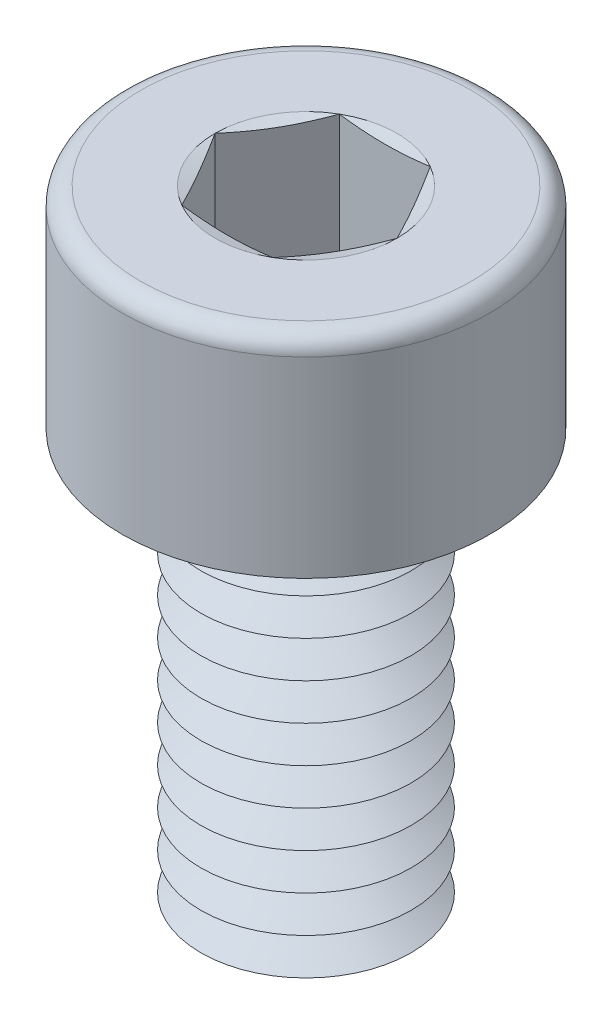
ISO-10303-21;
HEADER;
FILE_DESCRIPTION(('STEP AP214'),'2;1');
FILE_NAME('part.step','',(''),(''),'','','');
FILE_SCHEMA(('AUTOMOTIVE_DESIGN { 1 0 10303 214 1 1 1 1 }'));
ENDSEC;
DATA;
#1=APPLICATION_CONTEXT('core data for automotive mechanical design processes');
#2=APPLICATION_PROTOCOL_DEFINITION('international standard','automotive_design',2000,#1);
#3=PRODUCT_CONTEXT('',#1,'mechanical');
#4=PRODUCT('Part','Part','',(#3));
#5=PRODUCT_RELATED_PRODUCT_CATEGORY('part','',(#4));
#6=PRODUCT_DEFINITION_FORMATION('','',#4);
#7=PRODUCT_DEFINITION_CONTEXT('part definition',#1,'design');
#8=PRODUCT_DEFINITION('design','',#6,#7);
#9=PRODUCT_DEFINITION_SHAPE('','',#8);
#10=(LENGTH_UNIT() NAMED_UNIT(*) SI_UNIT(.MILLI.,.METRE.));
#11=(NAMED_UNIT(*) PLANE_ANGLE_UNIT() SI_UNIT($,.RADIAN.));
#12=(NAMED_UNIT(*) SI_UNIT($,.STERADIAN.) SOLID_ANGLE_UNIT());
#13=UNCERTAINTY_MEASURE_WITH_UNIT(LENGTH_MEASURE(1.E-05),#10,'distance_accuracy_value','');
#14=(GEOMETRIC_REPRESENTATION_CONTEXT(3) GLOBAL_UNCERTAINTY_ASSIGNED_CONTEXT((#13)) GLOBAL_UNIT_ASSIGNED_CONTEXT((#10,
#11,#12)) REPRESENTATION_CONTEXT('',''));
#15=CARTESIAN_POINT('',(0.,0.,0.));
#16=DIRECTION('',(0.,0.,1.));
#17=DIRECTION('',(1.,0.,0.));
#18=AXIS2_PLACEMENT_3D('',#15,#16,#17);
#19=CARTESIAN_POINT('',(0.,2.8,0.));
#20=DIRECTION('',(0.,1.,0.));
#21=DIRECTION('',(0.,0.,1.));
#22=AXIS2_PLACEMENT_3D('',#19,#20,#21);
#23=CONICAL_SURFACE('',#22,1.39378221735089,1.0471975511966);
#24=CARTESIAN_POINT('',(0.,3.15,0.));
#25=DIRECTION('',(0.,1.,0.));
#26=DIRECTION('',(0.,0.,1.));
#27=AXIS2_PLACEMENT_3D('',#24,#25,#26);
#28=CIRCLE('',#27,2.);
#29=CARTESIAN_POINT('',(0.,3.15,2.));
#30=VERTEX_POINT('',#29);
#31=EDGE_CURVE('E399',#30,#30,#28,.T.);
#32=ORIENTED_EDGE('',*,*,#31,.F.);
#33=EDGE_LOOP('',(#32));
#34=FACE_BOUND('',#33,.T.);
#35=CARTESIAN_POINT('',(0.,2.8,0.));
#36=DIRECTION('',(0.,1.,0.));
#37=DIRECTION('',(0.,0.,1.));
#38=AXIS2_PLACEMENT_3D('',#35,#36,#37);
#39=CIRCLE('',#38,1.39378221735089);
#40=CARTESIAN_POINT('',(0.,2.8,1.39378221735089));
#41=VERTEX_POINT('',#40);
#42=EDGE_CURVE('E403',#41,#41,#39,.T.);
#43=ORIENTED_EDGE('',*,*,#42,.T.);
#44=EDGE_LOOP('',(#43));
#45=FACE_BOUND('',#44,.T.);
#46=ADVANCED_FACE('F41',(#34,#45),#23,.T.);
#47=CARTESIAN_POINT('',(0.,2.45,0.));
#48=DIRECTION('',(0.,-1.,0.));
#49=DIRECTION('',(0.,0.,-1.));
#50=AXIS2_PLACEMENT_3D('',#47,#48,#49);
#51=CONICAL_SURFACE('',#50,2.,1.0471975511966);
#52=ORIENTED_EDGE('',*,*,#42,.F.);
#53=EDGE_LOOP('',(#52));
#54=FACE_BOUND('',#53,.T.);
#55=CARTESIAN_POINT('',(0.,2.45,0.));
#56=DIRECTION('',(0.,1.,0.));
#57=DIRECTION('',(0.,0.,1.));
#58=AXIS2_PLACEMENT_3D('',#55,#56,#57);
#59=CIRCLE('',#58,2.);
#60=CARTESIAN_POINT('',(0.,2.45,2.));
#61=VERTEX_POINT('',#60);
#62=EDGE_CURVE('E407',#61,#61,#59,.T.);
#63=ORIENTED_EDGE('',*,*,#62,.T.);
#64=EDGE_LOOP('',(#63));
#65=FACE_BOUND('',#64,.T.);
#66=ADVANCED_FACE('F250',(#54,#65),#51,.T.);
#67=CARTESIAN_POINT('',(0.,0.,0.));
#68=DIRECTION('',(0.,1.,0.));
#69=DIRECTION('',(0.,0.,1.));
#70=AXIS2_PLACEMENT_3D('',#67,#68,#69);
#71=PLANE('',#70);
#72=CARTESIAN_POINT('',(0.,0.,0.));
#73=DIRECTION('',(0.,1.,0.));
#74=DIRECTION('',(0.,0.,1.));
#75=AXIS2_PLACEMENT_3D('',#72,#73,#74);
#76=CIRCLE('',#75,1.39378221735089);
#77=CARTESIAN_POINT('',(0.,0.,1.39378221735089));
#78=VERTEX_POINT('',#77);
#79=EDGE_CURVE('E434',#78,#78,#76,.T.);
#80=ORIENTED_EDGE('',*,*,#79,.F.);
#81=EDGE_LOOP('',(#80));
#82=FACE_BOUND('',#81,.T.);
#83=ADVANCED_FACE('F247',(#82),#71,.F.);
#84=CARTESIAN_POINT('',(0.,0.,0.));
#85=DIRECTION('',(0.,1.,0.));
#86=DIRECTION('',(0.,0.,1.));
#87=AXIS2_PLACEMENT_3D('',#84,#85,#86);
#88=CONICAL_SURFACE('',#87,1.39378221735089,1.0471975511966);
#89=CARTESIAN_POINT('',(0.,0.35,0.));
#90=DIRECTION('',(0.,1.,0.));
#91=DIRECTION('',(0.,0.,1.));
#92=AXIS2_PLACEMENT_3D('',#89,#90,#91);
#93=CIRCLE('',#92,2.);
#94=CARTESIAN_POINT('',(0.,0.35,2.));
#95=VERTEX_POINT('',#94);
#96=EDGE_CURVE('E430',#95,#95,#93,.T.);
#97=ORIENTED_EDGE('',*,*,#96,.F.);
#98=EDGE_LOOP('',(#97));
#99=FACE_BOUND('',#98,.T.);
#100=ORIENTED_EDGE('',*,*,#79,.T.);
#101=EDGE_LOOP('',(#100));
#102=FACE_BOUND('',#101,.T.);
#103=ADVANCED_FACE('F249',(#99,#102),#88,.T.);
#104=CARTESIAN_POINT('',(0.,0.35,0.));
#105=DIRECTION('',(0.,-1.,0.));
#106=DIRECTION('',(0.,0.,-1.));
#107=AXIS2_PLACEMENT_3D('',#104,#105,#106);
#108=CONICAL_SURFACE('',#107,2.,1.0471975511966);
#109=CARTESIAN_POINT('',(0.,0.7,0.));
#110=DIRECTION('',(0.,1.,0.));
#111=DIRECTION('',(0.,0.,1.));
#112=AXIS2_PLACEMENT_3D('',#109,#110,#111);
#113=CIRCLE('',#112,1.39378221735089);
#114=CARTESIAN_POINT('',(0.,0.7,1.39378221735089));
#115=VERTEX_POINT('',#114);
#116=EDGE_CURVE('E426',#115,#115,#113,.T.);
#117=ORIENTED_EDGE('',*,*,#116,.F.);
#118=EDGE_LOOP('',(#117));
#119=FACE_BOUND('',#118,.T.);
#120=ORIENTED_EDGE('',*,*,#96,.T.);
#121=EDGE_LOOP('',(#120));
#122=FACE_BOUND('',#121,.T.);
#123=ADVANCED_FACE('F290',(#119,#122),#108,.T.);
#124=CARTESIAN_POINT('',(0.,0.7,0.));
#125=DIRECTION('',(0.,1.,0.));
#126=DIRECTION('',(0.,0.,1.));
#127=AXIS2_PLACEMENT_3D('',#124,#125,#126);
#128=CONICAL_SURFACE('',#127,1.39378221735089,1.0471975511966);
#129=CARTESIAN_POINT('',(0.,1.05,0.));
#130=DIRECTION('',(0.,1.,0.));
#131=DIRECTION('',(0.,0.,1.));
#132=AXIS2_PLACEMENT_3D('',#129,#130,#131);
#133=CIRCLE('',#132,2.);
#134=CARTESIAN_POINT('',(0.,1.05,2.));
#135=VERTEX_POINT('',#134);
#136=EDGE_CURVE('E422',#135,#135,#133,.T.);
#137=ORIENTED_EDGE('',*,*,#136,.F.);
#138=EDGE_LOOP('',(#137));
#139=FACE_BOUND('',#138,.T.);
#140=ORIENTED_EDGE('',*,*,#116,.T.);
#141=EDGE_LOOP('',(#140));
#142=FACE_BOUND('',#141,.T.);
#143=ADVANCED_FACE('F285',(#139,#142),#128,.T.);
#144=CARTESIAN_POINT('',(0.,1.05,0.));
#145=DIRECTION('',(0.,-1.,0.));
#146=DIRECTION('',(0.,0.,-1.));
#147=AXIS2_PLACEMENT_3D('',#144,#145,#146);
#148=CONICAL_SURFACE('',#147,2.,1.0471975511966);
#149=CARTESIAN_POINT('',(0.,1.4,0.));
#150=DIRECTION('',(0.,1.,0.));
#151=DIRECTION('',(0.,0.,1.));
#152=AXIS2_PLACEMENT_3D('',#149,#150,#151);
#153=CIRCLE('',#152,1.39378221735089);
#154=CARTESIAN_POINT('',(0.,1.4,1.39378221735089));
#155=VERTEX_POINT('',#154);
#156=EDGE_CURVE('E418',#155,#155,#153,.T.);
#157=ORIENTED_EDGE('',*,*,#156,.F.);
#158=EDGE_LOOP('',(#157));
#159=FACE_BOUND('',#158,.T.);
#160=ORIENTED_EDGE('',*,*,#136,.T.);
#161=EDGE_LOOP('',(#160));
#162=FACE_BOUND('',#161,.T.);
#163=ADVANCED_FACE('F282',(#159,#162),#148,.T.);
#164=CARTESIAN_POINT('',(0.,1.4,0.));
#165=DIRECTION('',(0.,1.,0.));
#166=DIRECTION('',(0.,0.,1.));
#167=AXIS2_PLACEMENT_3D('',#164,#165,#166);
#168=CONICAL_SURFACE('',#167,1.39378221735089,1.0471975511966);
#169=CARTESIAN_POINT('',(0.,1.75,0.));
#170=DIRECTION('',(0.,1.,0.));
#171=DIRECTION('',(0.,0.,1.));
#172=AXIS2_PLACEMENT_3D('',#169,#170,#171);
#173=CIRCLE('',#172,2.);
#174=CARTESIAN_POINT('',(0.,1.75,2.));
#175=VERTEX_POINT('',#174);
#176=EDGE_CURVE('E414',#175,#175,#173,.T.);
#177=ORIENTED_EDGE('',*,*,#176,.F.);
#178=EDGE_LOOP('',(#177));
#179=FACE_BOUND('',#178,.T.);
#180=ORIENTED_EDGE('',*,*,#156,.T.);
#181=EDGE_LOOP('',(#180));
#182=FACE_BOUND('',#181,.T.);
#183=ADVANCED_FACE('F276',(#179,#182),#168,.T.);
#184=CARTESIAN_POINT('',(0.,1.75,0.));
#185=DIRECTION('',(0.,-1.,0.));
#186=DIRECTION('',(0.,0.,-1.));
#187=AXIS2_PLACEMENT_3D('',#184,#185,#186);
#188=CONICAL_SURFACE('',#187,2.,1.0471975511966);
#189=CARTESIAN_POINT('',(0.,2.1,0.));
#190=DIRECTION('',(0.,1.,0.));
#191=DIRECTION('',(0.,0.,1.));
#192=AXIS2_PLACEMENT_3D('',#189,#190,#191);
#193=CIRCLE('',#192,1.39378221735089);
#194=CARTESIAN_POINT('',(0.,2.1,1.39378221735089));
#195=VERTEX_POINT('',#194);
#196=EDGE_CURVE('E410',#195,#195,#193,.T.);
#197=ORIENTED_EDGE('',*,*,#196,.F.);
#198=EDGE_LOOP('',(#197));
#199=FACE_BOUND('',#198,.T.);
#200=ORIENTED_EDGE('',*,*,#176,.T.);
#201=EDGE_LOOP('',(#200));
#202=FACE_BOUND('',#201,.T.);
#203=ADVANCED_FACE('F272',(#199,#202),#188,.T.);
#204=CARTESIAN_POINT('',(0.,2.1,0.));
#205=DIRECTION('',(0.,1.,0.));
#206=DIRECTION('',(0.,0.,1.));
#207=AXIS2_PLACEMENT_3D('',#204,#205,#206);
#208=CONICAL_SURFACE('',#207,1.39378221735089,1.0471975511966);
#209=ORIENTED_EDGE('',*,*,#62,.F.);
#210=EDGE_LOOP('',(#209));
#211=FACE_BOUND('',#210,.T.);
#212=ORIENTED_EDGE('',*,*,#196,.T.);
#213=EDGE_LOOP('',(#212));
#214=FACE_BOUND('',#213,.T.);
#215=ADVANCED_FACE('F275',(#211,#214),#208,.T.);
#216=CARTESIAN_POINT('',(0.,3.5,0.));
#217=DIRECTION('',(0.,1.,0.));
#218=DIRECTION('',(0.,0.,1.));
#219=AXIS2_PLACEMENT_3D('',#216,#217,#218);
#220=CONICAL_SURFACE('',#219,1.39378221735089,1.0471975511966);
#221=CARTESIAN_POINT('',(0.,3.85,0.));
#222=DIRECTION('',(0.,1.,0.));
#223=DIRECTION('',(0.,0.,1.));
#224=AXIS2_PLACEMENT_3D('',#221,#222,#223);
#225=CIRCLE('',#224,2.);
#226=CARTESIAN_POINT('',(0.,3.85,2.));
#227=VERTEX_POINT('',#226);
#228=EDGE_CURVE('E391',#227,#227,#225,.T.);
#229=ORIENTED_EDGE('',*,*,#228,.F.);
#230=EDGE_LOOP('',(#229));
#231=FACE_BOUND('',#230,.T.);
#232=CARTESIAN_POINT('',(0.,3.5,0.));
#233=DIRECTION('',(0.,1.,0.));
#234=DIRECTION('',(0.,0.,1.));
#235=AXIS2_PLACEMENT_3D('',#232,#233,#234);
#236=CIRCLE('',#235,1.39378221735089);
#237=CARTESIAN_POINT('',(0.,3.5,1.39378221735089));
#238=VERTEX_POINT('',#237);
#239=EDGE_CURVE('E395',#238,#238,#236,.T.);
#240=ORIENTED_EDGE('',*,*,#239,.T.);
#241=EDGE_LOOP('',(#240));
#242=FACE_BOUND('',#241,.T.);
#243=ADVANCED_FACE('F280',(#231,#242),#220,.T.);
#244=CARTESIAN_POINT('',(0.,3.15,0.));
#245=DIRECTION('',(0.,-1.,0.));
#246=DIRECTION('',(0.,0.,-1.));
#247=AXIS2_PLACEMENT_3D('',#244,#245,#246);
#248=CONICAL_SURFACE('',#247,2.,1.0471975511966);
#249=ORIENTED_EDGE('',*,*,#239,.F.);
#250=EDGE_LOOP('',(#249));
#251=FACE_BOUND('',#250,.T.);
#252=ORIENTED_EDGE('',*,*,#31,.T.);
#253=EDGE_LOOP('',(#252));
#254=FACE_BOUND('',#253,.T.);
#255=ADVANCED_FACE('F669',(#251,#254),#248,.T.);
#256=CARTESIAN_POINT('',(0.,4.2,0.));
#257=DIRECTION('',(0.,1.,0.));
#258=DIRECTION('',(0.,0.,1.));
#259=AXIS2_PLACEMENT_3D('',#256,#257,#258);
#260=CONICAL_SURFACE('',#259,1.39378221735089,1.0471975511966);
#261=CARTESIAN_POINT('',(0.,4.55,0.));
#262=DIRECTION('',(0.,1.,0.));
#263=DIRECTION('',(0.,0.,1.));
#264=AXIS2_PLACEMENT_3D('',#261,#262,#263);
#265=CIRCLE('',#264,2.);
#266=CARTESIAN_POINT('',(0.,4.55,2.));
#267=VERTEX_POINT('',#266);
#268=EDGE_CURVE('E384',#267,#267,#265,.T.);
#269=ORIENTED_EDGE('',*,*,#268,.F.);
#270=EDGE_LOOP('',(#269));
#271=FACE_BOUND('',#270,.T.);
#272=CARTESIAN_POINT('',(0.,4.2,0.));
#273=DIRECTION('',(0.,1.,0.));
#274=DIRECTION('',(0.,0.,1.));
#275=AXIS2_PLACEMENT_3D('',#272,#273,#274);
#276=CIRCLE('',#275,1.39378221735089);
#277=CARTESIAN_POINT('',(0.,4.2,1.39378221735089));
#278=VERTEX_POINT('',#277);
#279=EDGE_CURVE('E387',#278,#278,#276,.T.);
#280=ORIENTED_EDGE('',*,*,#279,.T.);
#281=EDGE_LOOP('',(#280));
#282=FACE_BOUND('',#281,.T.);
#283=ADVANCED_FACE('F660',(#271,#282),#260,.T.);
#284=CARTESIAN_POINT('',(0.,3.85,0.));
#285=DIRECTION('',(0.,-1.,0.));
#286=DIRECTION('',(0.,0.,-1.));
#287=AXIS2_PLACEMENT_3D('',#284,#285,#286);
#288=CONICAL_SURFACE('',#287,2.,1.0471975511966);
#289=ORIENTED_EDGE('',*,*,#279,.F.);
#290=EDGE_LOOP('',(#289));
#291=FACE_BOUND('',#290,.T.);
#292=ORIENTED_EDGE('',*,*,#228,.T.);
#293=EDGE_LOOP('',(#292));
#294=FACE_BOUND('',#293,.T.);
#295=ADVANCED_FACE('F651',(#291,#294),#288,.T.);
#296=CARTESIAN_POINT('',(0.,4.9,0.));
#297=DIRECTION('',(0.,1.,0.));
#298=DIRECTION('',(0.,0.,1.));
#299=AXIS2_PLACEMENT_3D('',#296,#297,#298);
#300=CONICAL_SURFACE('',#299,1.39378221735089,1.0471975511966);
#301=CARTESIAN_POINT('',(0.,5.25,0.));
#302=DIRECTION('',(0.,1.,0.));
#303=DIRECTION('',(0.,0.,1.));
#304=AXIS2_PLACEMENT_3D('',#301,#302,#303);
#305=CIRCLE('',#304,2.);
#306=CARTESIAN_POINT('',(0.,5.25,2.));
#307=VERTEX_POINT('',#306);
#308=EDGE_CURVE('E376',#307,#307,#305,.T.);
#309=ORIENTED_EDGE('',*,*,#308,.F.);
#310=EDGE_LOOP('',(#309));
#311=FACE_BOUND('',#310,.T.);
#312=CARTESIAN_POINT('',(0.,4.9,0.));
#313=DIRECTION('',(0.,1.,0.));
#314=DIRECTION('',(0.,0.,1.));
#315=AXIS2_PLACEMENT_3D('',#312,#313,#314);
#316=CIRCLE('',#315,1.39378221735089);
#317=CARTESIAN_POINT('',(0.,4.9,1.39378221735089));
#318=VERTEX_POINT('',#317);
#319=EDGE_CURVE('E380',#318,#318,#316,.T.);
#320=ORIENTED_EDGE('',*,*,#319,.T.);
#321=EDGE_LOOP('',(#320));
#322=FACE_BOUND('',#321,.T.);
#323=ADVANCED_FACE('F642',(#311,#322),#300,.T.);
#324=CARTESIAN_POINT('',(0.,4.55,0.));
#325=DIRECTION('',(0.,-1.,0.));
#326=DIRECTION('',(0.,0.,-1.));
#327=AXIS2_PLACEMENT_3D('',#324,#325,#326);
#328=CONICAL_SURFACE('',#327,2.,1.0471975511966);
#329=ORIENTED_EDGE('',*,*,#319,.F.);
#330=EDGE_LOOP('',(#329));
#331=FACE_BOUND('',#330,.T.);
#332=ORIENTED_EDGE('',*,*,#268,.T.);
#333=EDGE_LOOP('',(#332));
#334=FACE_BOUND('',#333,.T.);
#335=ADVANCED_FACE('F633',(#331,#334),#328,.T.);
#336=CARTESIAN_POINT('',(0.,5.6,0.));
#337=DIRECTION('',(0.,1.,0.));
#338=DIRECTION('',(0.,0.,1.));
#339=AXIS2_PLACEMENT_3D('',#336,#337,#338);
#340=CONICAL_SURFACE('',#339,1.39378221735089,1.0471975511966);
#341=CARTESIAN_POINT('',(0.,5.95,0.));
#342=DIRECTION('',(0.,1.,0.));
#343=DIRECTION('',(0.,0.,1.));
#344=AXIS2_PLACEMENT_3D('',#341,#342,#343);
#345=CIRCLE('',#344,2.);
#346=CARTESIAN_POINT('',(0.,5.95,2.));
#347=VERTEX_POINT('',#346);
#348=EDGE_CURVE('E368',#347,#347,#345,.T.);
#349=ORIENTED_EDGE('',*,*,#348,.F.);
#350=EDGE_LOOP('',(#349));
#351=FACE_BOUND('',#350,.T.);
#352=CARTESIAN_POINT('',(0.,5.6,0.));
#353=DIRECTION('',(0.,1.,0.));
#354=DIRECTION('',(0.,0.,1.));
#355=AXIS2_PLACEMENT_3D('',#352,#353,#354);
#356=CIRCLE('',#355,1.39378221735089);
#357=CARTESIAN_POINT('',(0.,5.6,1.39378221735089));
#358=VERTEX_POINT('',#357);
#359=EDGE_CURVE('E372',#358,#358,#356,.T.);
#360=ORIENTED_EDGE('',*,*,#359,.T.);
#361=EDGE_LOOP('',(#360));
#362=FACE_BOUND('',#361,.T.);
#363=ADVANCED_FACE('F624',(#351,#362),#340,.T.);
#364=CARTESIAN_POINT('',(0.,5.25,0.));
#365=DIRECTION('',(0.,-1.,0.));
#366=DIRECTION('',(0.,0.,-1.));
#367=AXIS2_PLACEMENT_3D('',#364,#365,#366);
#368=CONICAL_SURFACE('',#367,2.,1.0471975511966);
#369=ORIENTED_EDGE('',*,*,#359,.F.);
#370=EDGE_LOOP('',(#369));
#371=FACE_BOUND('',#370,.T.);
#372=ORIENTED_EDGE('',*,*,#308,.T.);
#373=EDGE_LOOP('',(#372));
#374=FACE_BOUND('',#373,.T.);
#375=ADVANCED_FACE('F615',(#371,#374),#368,.T.);
#376=CARTESIAN_POINT('',(0.,6.3,0.));
#377=DIRECTION('',(0.,1.,0.));
#378=DIRECTION('',(0.,0.,1.));
#379=AXIS2_PLACEMENT_3D('',#376,#377,#378);
#380=CONICAL_SURFACE('',#379,1.39378221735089,1.0471975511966);
#381=CARTESIAN_POINT('',(0.,6.65,0.));
#382=DIRECTION('',(0.,1.,0.));
#383=DIRECTION('',(0.,0.,1.));
#384=AXIS2_PLACEMENT_3D('',#381,#382,#383);
#385=CIRCLE('',#384,2.);
#386=CARTESIAN_POINT('',(0.,6.65,2.));
#387=VERTEX_POINT('',#386);
#388=EDGE_CURVE('E352',#387,#387,#385,.T.);
#389=ORIENTED_EDGE('',*,*,#388,.F.);
#390=EDGE_LOOP('',(#389));
#391=FACE_BOUND('',#390,.T.);
#392=CARTESIAN_POINT('',(0.,6.3,0.));
#393=DIRECTION('',(0.,1.,0.));
#394=DIRECTION('',(0.,0.,1.));
#395=AXIS2_PLACEMENT_3D('',#392,#393,#394);
#396=CIRCLE('',#395,1.39378221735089);
#397=CARTESIAN_POINT('',(0.,6.3,1.39378221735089));
#398=VERTEX_POINT('',#397);
#399=EDGE_CURVE('E364',#398,#398,#396,.T.);
#400=ORIENTED_EDGE('',*,*,#399,.T.);
#401=EDGE_LOOP('',(#400));
#402=FACE_BOUND('',#401,.T.);
#403=ADVANCED_FACE('F606',(#391,#402),#380,.T.);
#404=CARTESIAN_POINT('',(0.,5.95,0.));
#405=DIRECTION('',(0.,-1.,0.));
#406=DIRECTION('',(0.,0.,-1.));
#407=AXIS2_PLACEMENT_3D('',#404,#405,#406);
#408=CONICAL_SURFACE('',#407,2.,1.0471975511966);
#409=ORIENTED_EDGE('',*,*,#399,.F.);
#410=EDGE_LOOP('',(#409));
#411=FACE_BOUND('',#410,.T.);
#412=ORIENTED_EDGE('',*,*,#348,.T.);
#413=EDGE_LOOP('',(#412));
#414=FACE_BOUND('',#413,.T.);
#415=ADVANCED_FACE('F598',(#411,#414),#408,.T.);
#416=CARTESIAN_POINT('',(0.,7.,0.));
#417=DIRECTION('',(0.,1.,0.));
#418=DIRECTION('',(0.,0.,1.));
#419=AXIS2_PLACEMENT_3D('',#416,#417,#418);
#420=CONICAL_SURFACE('',#419,1.39378221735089,1.0471975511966);
#421=CARTESIAN_POINT('',(0.,7.35,0.));
#422=DIRECTION('',(0.,1.,0.));
#423=DIRECTION('',(0.,0.,1.));
#424=AXIS2_PLACEMENT_3D('',#421,#422,#423);
#425=CIRCLE('',#424,2.);
#426=CARTESIAN_POINT('',(0.,7.35,2.));
#427=VERTEX_POINT('',#426);
#428=EDGE_CURVE('E359',#427,#427,#425,.T.);
#429=ORIENTED_EDGE('',*,*,#428,.F.);
#430=EDGE_LOOP('',(#429));
#431=FACE_BOUND('',#430,.T.);
#432=CARTESIAN_POINT('',(0.,7.,0.));
#433=DIRECTION('',(0.,1.,0.));
#434=DIRECTION('',(0.,0.,1.));
#435=AXIS2_PLACEMENT_3D('',#432,#433,#434);
#436=CIRCLE('',#435,1.39378221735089);
#437=CARTESIAN_POINT('',(0.,7.,1.39378221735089));
#438=VERTEX_POINT('',#437);
#439=EDGE_CURVE('E347',#438,#438,#436,.T.);
#440=ORIENTED_EDGE('',*,*,#439,.T.);
#441=EDGE_LOOP('',(#440));
#442=FACE_BOUND('',#441,.T.);
#443=ADVANCED_FACE('F590',(#431,#442),#420,.T.);
#444=CARTESIAN_POINT('',(0.,6.65,0.));
#445=DIRECTION('',(0.,-1.,0.));
#446=DIRECTION('',(0.,0.,-1.));
#447=AXIS2_PLACEMENT_3D('',#444,#445,#446);
#448=CONICAL_SURFACE('',#447,2.,1.0471975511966);
#449=ORIENTED_EDGE('',*,*,#439,.F.);
#450=EDGE_LOOP('',(#449));
#451=FACE_BOUND('',#450,.T.);
#452=ORIENTED_EDGE('',*,*,#388,.T.);
#453=EDGE_LOOP('',(#452));
#454=FACE_BOUND('',#453,.T.);
#455=ADVANCED_FACE('F194',(#451,#454),#448,.T.);
#456=CARTESIAN_POINT('',(0.,12.,0.));
#457=DIRECTION('',(0.,1.,0.));
#458=DIRECTION('',(0.,0.,1.));
#459=AXIS2_PLACEMENT_3D('',#456,#457,#458);
#460=PLANE('',#459);
#461=CARTESIAN_POINT('',(0.,12.,0.));
#462=DIRECTION('',(0.,1.,0.));
#463=DIRECTION('',(0.,0.,1.));
#464=AXIS2_PLACEMENT_3D('',#461,#462,#463);
#465=CIRCLE('',#464,1.73205080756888);
#466=CARTESIAN_POINT('',(0.866025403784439,12.,1.5));
#467=VERTEX_POINT('',#466);
#468=CARTESIAN_POINT('',(1.73205080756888,12.,0.));
#469=VERTEX_POINT('',#468);
#470=EDGE_CURVE('E121',#467,#469,#465,.T.);
#471=ORIENTED_EDGE('',*,*,#470,.F.);
#472=CARTESIAN_POINT('',(0.,12.,0.));
#473=DIRECTION('',(0.,1.,0.));
#474=DIRECTION('',(0.,0.,1.));
#475=AXIS2_PLACEMENT_3D('',#472,#473,#474);
#476=CIRCLE('',#475,1.73205080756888);
#477=CARTESIAN_POINT('',(-0.866025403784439,12.,1.5));
#478=VERTEX_POINT('',#477);
#479=EDGE_CURVE('E45',#478,#467,#476,.T.);
#480=ORIENTED_EDGE('',*,*,#479,.F.);
#481=CARTESIAN_POINT('',(-1.73205080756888,12.,0.));
#482=VERTEX_POINT('',#481);
#483=EDGE_CURVE('E138',#482,#478,#476,.T.);
#484=ORIENTED_EDGE('',*,*,#483,.F.);
#485=CARTESIAN_POINT('',(-0.866025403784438,12.,-1.5));
#486=VERTEX_POINT('',#485);
#487=EDGE_CURVE('E914',#486,#482,#476,.T.);
#488=ORIENTED_EDGE('',*,*,#487,.F.);
#489=CARTESIAN_POINT('',(0.866025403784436,12.,-1.5));
#490=VERTEX_POINT('',#489);
#491=EDGE_CURVE('E51',#490,#486,#476,.T.);
#492=ORIENTED_EDGE('',*,*,#491,.F.);
#493=EDGE_CURVE('E11',#469,#490,#476,.T.);
#494=ORIENTED_EDGE('',*,*,#493,.F.);
#495=EDGE_LOOP('',(#471,#480,#484,#488,#492,#494));
#496=FACE_BOUND('',#495,.T.);
#497=CARTESIAN_POINT('',(0.,12.,0.));
#498=DIRECTION('',(0.,1.,0.));
#499=DIRECTION('',(0.,0.,1.));
#500=AXIS2_PLACEMENT_3D('',#497,#498,#499);
#501=CIRCLE('',#500,3.15);
#502=CARTESIAN_POINT('',(0.,12.,3.15));
#503=VERTEX_POINT('',#502);
#504=EDGE_CURVE('E478',#503,#503,#501,.T.);
#505=ORIENTED_EDGE('',*,*,#504,.T.);
#506=EDGE_LOOP('',(#505));
#507=FACE_BOUND('',#506,.T.);
#508=ADVANCED_FACE('F140',(#496,#507),#460,.T.);
#509=CARTESIAN_POINT('',(0.,11.65,0.));
#510=DIRECTION('',(0.,1.,0.));
#511=DIRECTION('',(0.,0.,1.));
#512=AXIS2_PLACEMENT_3D('',#509,#510,#511);
#513=TOROIDAL_SURFACE('',#512,3.15,0.35);
#514=CARTESIAN_POINT('',(0.,11.65,0.));
#515=DIRECTION('',(0.,1.,0.));
#516=DIRECTION('',(0.,0.,1.));
#517=AXIS2_PLACEMENT_3D('',#514,#515,#516);
#518=CIRCLE('',#517,3.5);
#519=CARTESIAN_POINT('',(0.,11.65,3.5));
#520=VERTEX_POINT('',#519);
#521=EDGE_CURVE('E481',#520,#520,#518,.F.);
#522=ORIENTED_EDGE('',*,*,#521,.F.);
#523=EDGE_LOOP('',(#522));
#524=FACE_BOUND('',#523,.T.);
#525=ORIENTED_EDGE('',*,*,#504,.F.);
#526=EDGE_LOOP('',(#525));
#527=FACE_BOUND('',#526,.T.);
#528=ADVANCED_FACE('F43',(#524,#527),#513,.T.);
#529=CARTESIAN_POINT('',(0.,12.,0.));
#530=DIRECTION('',(0.,-1.,0.));
#531=DIRECTION('',(0.,0.,-1.));
#532=AXIS2_PLACEMENT_3D('',#529,#530,#531);
#533=CYLINDRICAL_SURFACE('',#532,3.5);
#534=ORIENTED_EDGE('',*,*,#521,.T.);
#535=EDGE_LOOP('',(#534));
#536=FACE_BOUND('',#535,.T.);
#537=CARTESIAN_POINT('',(0.,8.,0.));
#538=DIRECTION('',(0.,1.,0.));
#539=DIRECTION('',(0.,0.,1.));
#540=AXIS2_PLACEMENT_3D('',#537,#538,#539);
#541=CIRCLE('',#540,3.5);
#542=CARTESIAN_POINT('',(0.,8.,3.5));
#543=VERTEX_POINT('',#542);
#544=EDGE_CURVE('E465',#543,#543,#541,.T.);
#545=ORIENTED_EDGE('',*,*,#544,.T.);
#546=EDGE_LOOP('',(#545));
#547=FACE_BOUND('',#546,.T.);
#548=ADVANCED_FACE('F242',(#536,#547),#533,.T.);
#549=CARTESIAN_POINT('',(0.,8.,0.));
#550=DIRECTION('',(0.,1.,0.));
#551=DIRECTION('',(0.,0.,1.));
#552=AXIS2_PLACEMENT_3D('',#549,#550,#551);
#553=PLANE('',#552);
#554=ORIENTED_EDGE('',*,*,#544,.F.);
#555=EDGE_LOOP('',(#554));
#556=FACE_BOUND('',#555,.T.);
#557=CARTESIAN_POINT('',(0.,8.,0.));
#558=DIRECTION('',(0.,1.,0.));
#559=DIRECTION('',(0.,0.,1.));
#560=AXIS2_PLACEMENT_3D('',#557,#558,#559);
#561=CIRCLE('',#560,2.);
#562=CARTESIAN_POINT('',(0.,8.,2.));
#563=VERTEX_POINT('',#562);
#564=EDGE_CURVE('E474',#563,#563,#561,.T.);
#565=ORIENTED_EDGE('',*,*,#564,.T.);
#566=EDGE_LOOP('',(#565));
#567=FACE_BOUND('',#566,.T.);
#568=ADVANCED_FACE('F238',(#556,#567),#553,.F.);
#569=CARTESIAN_POINT('',(0.,8.,0.));
#570=DIRECTION('',(0.,-1.,0.));
#571=DIRECTION('',(0.,0.,-1.));
#572=AXIS2_PLACEMENT_3D('',#569,#570,#571);
#573=CYLINDRICAL_SURFACE('',#572,2.);
#574=ORIENTED_EDGE('',*,*,#428,.T.);
#575=EDGE_LOOP('',(#574));
#576=FACE_BOUND('',#575,.T.);
#577=ORIENTED_EDGE('',*,*,#564,.F.);
#578=EDGE_LOOP('',(#577));
#579=FACE_BOUND('',#578,.T.);
#580=ADVANCED_FACE('F241',(#576,#579),#573,.T.);
#581=CARTESIAN_POINT('',(0.,12.,0.));
#582=DIRECTION('',(0.,1.,0.));
#583=DIRECTION('',(0.,0.,1.));
#584=AXIS2_PLACEMENT_3D('',#581,#582,#583);
#585=CONICAL_SURFACE('',#584,1.73205080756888,1.30899693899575);
#586=ORIENTED_EDGE('',*,*,#479,.T.);
#587=CARTESIAN_POINT('',(-2.26080568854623,12.2628876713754,1.5));
#588=CARTESIAN_POINT('',(-2.19307335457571,12.247767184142,1.5));
#589=CARTESIAN_POINT('',(-2.12529797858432,12.2328393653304,1.5));
#590=CARTESIAN_POINT('',(-1.98963961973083,12.203466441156,1.5));
#591=CARTESIAN_POINT('',(-1.92175663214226,12.1890213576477,1.5));
#592=CARTESIAN_POINT('',(-1.71778516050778,12.146529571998,1.5));
#593=CARTESIAN_POINT('',(-1.58151166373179,12.1193574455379,1.5));
#594=CARTESIAN_POINT('',(-1.30947840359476,12.0687885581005,1.5));
#595=CARTESIAN_POINT('',(-1.17372447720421,12.0453610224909,1.5));
#596=CARTESIAN_POINT('',(-0.901404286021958,12.0038503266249,1.5));
#597=CARTESIAN_POINT('',(-0.764838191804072,11.9857660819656,1.5));
#598=CARTESIAN_POINT('',(-0.48929318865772,11.9572920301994,1.5));
#599=CARTESIAN_POINT('',(-0.350304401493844,11.9469908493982,1.5));
#600=CARTESIAN_POINT('',(-0.141571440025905,11.9391816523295,1.5));
#601=CARTESIAN_POINT('',(-0.0719628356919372,11.937851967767,1.5));
#602=CARTESIAN_POINT('',(0.0672555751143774,11.9377933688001,1.5));
#603=CARTESIAN_POINT('',(0.136865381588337,11.9390644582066,1.5));
#604=CARTESIAN_POINT('',(0.346114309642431,11.9467225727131,1.5));
#605=CARTESIAN_POINT('',(0.485619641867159,11.9569747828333,1.5));
#606=CARTESIAN_POINT('',(0.763829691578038,11.9856001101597,1.5));
#607=CARTESIAN_POINT('',(0.902533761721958,12.0039790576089,1.5));
#608=CARTESIAN_POINT('',(1.18270277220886,12.0467752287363,1.5));
#609=CARTESIAN_POINT('',(1.32414472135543,12.0713381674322,1.5));
#610=CARTESIAN_POINT('',(1.60634089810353,12.1241771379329,1.5));
#611=CARTESIAN_POINT('',(1.7470950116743,12.1524537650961,1.5));
#612=CARTESIAN_POINT('',(2.02813528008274,12.2114128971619,1.5));
#613=CARTESIAN_POINT('',(2.16842128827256,12.2420960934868,1.5));
#614=CARTESIAN_POINT('',(2.4486355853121,12.3050575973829,1.5));
#615=CARTESIAN_POINT('',(2.58856386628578,12.3373359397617,1.5));
#616=CARTESIAN_POINT('',(2.86645602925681,12.4025869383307,1.5));
#617=CARTESIAN_POINT('',(3.00442304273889,12.435546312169,1.5));
#618=CARTESIAN_POINT('',(3.28017563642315,12.5022271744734,1.5));
#619=CARTESIAN_POINT('',(3.41796121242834,12.5359486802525,1.5));
#620=CARTESIAN_POINT('',(3.69320305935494,12.6038996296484,1.5));
#621=CARTESIAN_POINT('',(3.83065952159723,12.6381282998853,1.5));
#622=CARTESIAN_POINT('',(4.10546119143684,12.7070087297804,1.5));
#623=CARTESIAN_POINT('',(4.24280640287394,12.7416604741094,1.5));
#624=CARTESIAN_POINT('',(4.38011382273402,12.7764596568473,1.5));
#625=B_SPLINE_CURVE_WITH_KNOTS('',3,(#587,#588,#589,#590,#591,#592,#593,#594,#595,#596,#597,
#598,#599,#600,#601,#602,#603,#604,#605,#606,#607,#608,#609,#610,#611,#612,#613,#614,#615,#616,
#617,#618,#619,#620,#621,#622,#623,#624),.UNSPECIFIED.,.F.,.F.,(4,2,2,2,2,2,2,2,2,2,2,2,2,2,2,2,
2,2,4),(0.,0.208198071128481,0.416405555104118,0.833243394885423,1.24645656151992,
1.65958581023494,2.07735129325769,2.28617008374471,2.49498918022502,2.91428402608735,
3.33388016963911,3.76448033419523,4.19514961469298,4.6259430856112,5.05674596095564,
5.48229088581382,5.90784548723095,6.33280701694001,6.75775319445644),.UNSPECIFIED.);
#626=EDGE_CURVE('E127',#478,#467,#625,.T.);
#627=ORIENTED_EDGE('',*,*,#626,.F.);
#628=EDGE_LOOP('',(#586,#627));
#629=FACE_BOUND('',#628,.T.);
#630=ADVANCED_FACE('F132',(#629),#585,.F.);
#631=ORIENTED_EDGE('',*,*,#483,.T.);
#632=CARTESIAN_POINT('',(-1.73216627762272,12.0000309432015,-0.000200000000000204));
#633=CARTESIAN_POINT('',(-1.69619286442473,11.9903863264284,0.0621077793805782));
#634=CARTESIAN_POINT('',(-1.66015421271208,11.9816304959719,0.124528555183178));
#635=CARTESIAN_POINT('',(-1.58794959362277,11.9662471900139,0.249590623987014));
#636=CARTESIAN_POINT('',(-1.55178358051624,11.9596205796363,0.312231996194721));
#637=CARTESIAN_POINT('',(-1.47954358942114,11.948882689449,0.437355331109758));
#638=CARTESIAN_POINT('',(-1.44347010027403,11.9447586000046,0.499836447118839));
#639=CARTESIAN_POINT('',(-1.37127710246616,11.9392286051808,0.624878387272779));
#640=CARTESIAN_POINT('',(-1.33515760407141,11.9378221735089,0.687439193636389));
#641=CARTESIAN_POINT('',(-1.26291860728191,11.9378221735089,0.81256080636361));
#642=CARTESIAN_POINT('',(-1.22679910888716,11.9392286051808,0.87512161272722));
#643=CARTESIAN_POINT('',(-1.15460611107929,11.9447586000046,1.00016355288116));
#644=CARTESIAN_POINT('',(-1.11853262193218,11.948882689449,1.06264466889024));
#645=CARTESIAN_POINT('',(-1.04629263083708,11.9596205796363,1.18776800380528));
#646=CARTESIAN_POINT('',(-1.01012661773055,11.9662471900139,1.25040937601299));
#647=CARTESIAN_POINT('',(-0.937921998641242,11.9816304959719,1.37547144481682));
#648=CARTESIAN_POINT('',(-0.901883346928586,11.9903863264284,1.43789222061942));
#649=CARTESIAN_POINT('',(-0.865909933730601,12.0000309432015,1.5002));
#650=B_SPLINE_CURVE_WITH_KNOTS('',3,(#632,#633,#634,#635,#636,#637,#638,#639,#640,#641,#642,
#643,#644,#645,#646,#647,#648,#649),.UNSPECIFIED.,.F.,.F.,(4,2,2,2,2,2,2,2,4),(0.,
0.217782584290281,0.435653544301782,0.652399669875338,0.869103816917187,1.08580796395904,
1.30255408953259,1.52042504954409,1.73820763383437),.UNSPECIFIED.);
#651=EDGE_CURVE('E163',#482,#478,#650,.T.);
#652=ORIENTED_EDGE('',*,*,#651,.F.);
#653=EDGE_LOOP('',(#631,#652));
#654=FACE_BOUND('',#653,.T.);
#655=ADVANCED_FACE('F257',(#654),#585,.F.);
#656=ORIENTED_EDGE('',*,*,#487,.T.);
#657=CARTESIAN_POINT('',(-0.865909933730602,12.0000309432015,-1.5002));
#658=CARTESIAN_POINT('',(-0.901883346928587,11.9903863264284,-1.43789222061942));
#659=CARTESIAN_POINT('',(-0.937921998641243,11.9816304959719,-1.37547144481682));
#660=CARTESIAN_POINT('',(-1.01012661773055,11.9662471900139,-1.25040937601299));
#661=CARTESIAN_POINT('',(-1.04629263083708,11.9596205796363,-1.18776800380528));
#662=CARTESIAN_POINT('',(-1.11853262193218,11.948882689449,-1.06264466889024));
#663=CARTESIAN_POINT('',(-1.15460611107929,11.9447586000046,-1.00016355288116));
#664=CARTESIAN_POINT('',(-1.22679910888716,11.9392286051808,-0.87512161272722));
#665=CARTESIAN_POINT('',(-1.26291860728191,11.9378221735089,-0.81256080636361));
#666=CARTESIAN_POINT('',(-1.33515760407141,11.9378221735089,-0.687439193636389));
#667=CARTESIAN_POINT('',(-1.37127710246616,11.9392286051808,-0.624878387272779));
#668=CARTESIAN_POINT('',(-1.44347010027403,11.9447586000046,-0.499836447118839));
#669=CARTESIAN_POINT('',(-1.47954358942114,11.948882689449,-0.437355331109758));
#670=CARTESIAN_POINT('',(-1.55178358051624,11.9596205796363,-0.312231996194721));
#671=CARTESIAN_POINT('',(-1.58794959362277,11.9662471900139,-0.249590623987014));
#672=CARTESIAN_POINT('',(-1.66015421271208,11.9816304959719,-0.124528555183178));
#673=CARTESIAN_POINT('',(-1.69619286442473,11.9903863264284,-0.0621077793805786));
#674=CARTESIAN_POINT('',(-1.73216627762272,12.0000309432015,0.000199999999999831));
#675=B_SPLINE_CURVE_WITH_KNOTS('',3,(#657,#658,#659,#660,#661,#662,#663,#664,#665,#666,#667,
#668,#669,#670,#671,#672,#673,#674),.UNSPECIFIED.,.F.,.F.,(4,2,2,2,2,2,2,2,4),(0.,
0.217782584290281,0.435653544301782,0.652399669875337,0.869103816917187,1.08580796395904,
1.30255408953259,1.52042504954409,1.73820763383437),.UNSPECIFIED.);
#676=EDGE_CURVE('E63',#486,#482,#675,.T.);
#677=ORIENTED_EDGE('',*,*,#676,.F.);
#678=EDGE_LOOP('',(#656,#677));
#679=FACE_BOUND('',#678,.T.);
#680=ADVANCED_FACE('F192',(#679),#585,.F.);
#681=ORIENTED_EDGE('',*,*,#491,.T.);
#682=CARTESIAN_POINT('',(-2.26080568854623,12.2628876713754,-1.5));
#683=CARTESIAN_POINT('',(-2.19307335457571,12.247767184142,-1.5));
#684=CARTESIAN_POINT('',(-2.12529797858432,12.2328393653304,-1.5));
#685=CARTESIAN_POINT('',(-1.98963961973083,12.203466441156,-1.5));
#686=CARTESIAN_POINT('',(-1.92175663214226,12.1890213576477,-1.5));
#687=CARTESIAN_POINT('',(-1.71778516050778,12.146529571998,-1.5));
#688=CARTESIAN_POINT('',(-1.58151166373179,12.1193574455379,-1.5));
#689=CARTESIAN_POINT('',(-1.30947840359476,12.0687885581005,-1.5));
#690=CARTESIAN_POINT('',(-1.17372447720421,12.0453610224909,-1.5));
#691=CARTESIAN_POINT('',(-0.901404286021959,12.0038503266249,-1.5));
#692=CARTESIAN_POINT('',(-0.764838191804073,11.9857660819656,-1.5));
#693=CARTESIAN_POINT('',(-0.489293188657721,11.9572920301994,-1.5));
#694=CARTESIAN_POINT('',(-0.350304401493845,11.9469908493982,-1.5));
#695=CARTESIAN_POINT('',(-0.141571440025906,11.9391816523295,-1.5));
#696=CARTESIAN_POINT('',(-0.071962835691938,11.937851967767,-1.5));
#697=CARTESIAN_POINT('',(0.0672555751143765,11.9377933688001,-1.5));
#698=CARTESIAN_POINT('',(0.136865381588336,11.9390644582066,-1.5));
#699=CARTESIAN_POINT('',(0.34611430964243,11.9467225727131,-1.5));
#700=CARTESIAN_POINT('',(0.485619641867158,11.9569747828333,-1.5));
#701=CARTESIAN_POINT('',(0.763829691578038,11.9856001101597,-1.5));
#702=CARTESIAN_POINT('',(0.902533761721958,12.0039790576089,-1.5));
#703=CARTESIAN_POINT('',(1.18270277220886,12.0467752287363,-1.5));
#704=CARTESIAN_POINT('',(1.32414472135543,12.0713381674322,-1.5));
#705=CARTESIAN_POINT('',(1.60634089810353,12.1241771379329,-1.5));
#706=CARTESIAN_POINT('',(1.7470950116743,12.1524537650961,-1.5));
#707=CARTESIAN_POINT('',(2.02813528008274,12.2114128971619,-1.5));
#708=CARTESIAN_POINT('',(2.16842128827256,12.2420960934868,-1.5));
#709=CARTESIAN_POINT('',(2.4486355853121,12.3050575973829,-1.5));
#710=CARTESIAN_POINT('',(2.58856386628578,12.3373359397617,-1.5));
#711=CARTESIAN_POINT('',(2.86645602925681,12.4025869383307,-1.5));
#712=CARTESIAN_POINT('',(3.00442304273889,12.435546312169,-1.5));
#713=CARTESIAN_POINT('',(3.28017563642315,12.5022271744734,-1.5));
#714=CARTESIAN_POINT('',(3.41796121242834,12.5359486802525,-1.5));
#715=CARTESIAN_POINT('',(3.69320305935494,12.6038996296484,-1.5));
#716=CARTESIAN_POINT('',(3.83065952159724,12.6381282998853,-1.5));
#717=CARTESIAN_POINT('',(4.10546119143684,12.7070087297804,-1.5));
#718=CARTESIAN_POINT('',(4.24280640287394,12.7416604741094,-1.5));
#719=CARTESIAN_POINT('',(4.38011382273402,12.7764596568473,-1.5));
#720=B_SPLINE_CURVE_WITH_KNOTS('',3,(#682,#683,#684,#685,#686,#687,#688,#689,#690,#691,#692,
#693,#694,#695,#696,#697,#698,#699,#700,#701,#702,#703,#704,#705,#706,#707,#708,#709,#710,#711,
#712,#713,#714,#715,#716,#717,#718,#719),.UNSPECIFIED.,.F.,.F.,(4,2,2,2,2,2,2,2,2,2,2,2,2,2,2,2,
2,2,4),(0.,0.208198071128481,0.416405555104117,0.833243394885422,1.24645656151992,
1.65958581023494,2.07735129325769,2.28617008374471,2.49498918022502,2.91428402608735,
3.33388016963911,3.76448033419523,4.19514961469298,4.62594308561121,5.05674596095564,
5.48229088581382,5.90784548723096,6.33280701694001,6.75775319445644),.UNSPECIFIED.);
#721=EDGE_CURVE('E213',#490,#486,#720,.F.);
#722=ORIENTED_EDGE('',*,*,#721,.F.);
#723=EDGE_LOOP('',(#681,#722));
#724=FACE_BOUND('',#723,.T.);
#725=ADVANCED_FACE('F187',(#724),#585,.F.);
#726=ORIENTED_EDGE('',*,*,#493,.T.);
#727=CARTESIAN_POINT('',(1.73216627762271,12.0000309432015,0.000200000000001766));
#728=CARTESIAN_POINT('',(1.69619286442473,11.9903863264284,-0.0621077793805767));
#729=CARTESIAN_POINT('',(1.66015421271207,11.9816304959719,-0.124528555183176));
#730=CARTESIAN_POINT('',(1.58794959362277,11.9662471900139,-0.249590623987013));
#731=CARTESIAN_POINT('',(1.55178358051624,11.9596205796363,-0.31223199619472));
#732=CARTESIAN_POINT('',(1.47954358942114,11.948882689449,-0.437355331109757));
#733=CARTESIAN_POINT('',(1.44347010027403,11.9447586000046,-0.499836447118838));
#734=CARTESIAN_POINT('',(1.37127710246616,11.9392286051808,-0.624878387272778));
#735=CARTESIAN_POINT('',(1.33515760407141,11.9378221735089,-0.687439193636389));
#736=CARTESIAN_POINT('',(1.26291860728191,11.9378221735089,-0.81256080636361));
#737=CARTESIAN_POINT('',(1.22679910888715,11.9392286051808,-0.87512161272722));
#738=CARTESIAN_POINT('',(1.15460611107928,11.9447586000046,-1.00016355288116));
#739=CARTESIAN_POINT('',(1.11853262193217,11.948882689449,-1.06264466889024));
#740=CARTESIAN_POINT('',(1.04629263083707,11.9596205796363,-1.18776800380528));
#741=CARTESIAN_POINT('',(1.01012661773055,11.9662471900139,-1.25040937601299));
#742=CARTESIAN_POINT('',(0.937921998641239,11.9816304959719,-1.37547144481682));
#743=CARTESIAN_POINT('',(0.901883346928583,11.9903863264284,-1.43789222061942));
#744=CARTESIAN_POINT('',(0.865909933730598,12.0000309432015,-1.5002));
#745=B_SPLINE_CURVE_WITH_KNOTS('',3,(#727,#728,#729,#730,#731,#732,#733,#734,#735,#736,#737,
#738,#739,#740,#741,#742,#743,#744),.UNSPECIFIED.,.F.,.F.,(4,2,2,2,2,2,2,2,4),(0.,
0.217782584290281,0.435653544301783,0.652399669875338,0.869103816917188,1.08580796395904,
1.30255408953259,1.5204250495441,1.73820763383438),.UNSPECIFIED.);
#746=EDGE_CURVE('E56',#469,#490,#745,.T.);
#747=ORIENTED_EDGE('',*,*,#746,.F.);
#748=EDGE_LOOP('',(#726,#747));
#749=FACE_BOUND('',#748,.T.);
#750=ADVANCED_FACE('F191',(#749),#585,.F.);
#751=ORIENTED_EDGE('',*,*,#470,.T.);
#752=CARTESIAN_POINT('',(0.865909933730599,12.0000309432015,1.5002));
#753=CARTESIAN_POINT('',(0.901883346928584,11.9903863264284,1.43789222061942));
#754=CARTESIAN_POINT('',(0.93792199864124,11.9816304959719,1.37547144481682));
#755=CARTESIAN_POINT('',(1.01012661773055,11.9662471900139,1.25040937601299));
#756=CARTESIAN_POINT('',(1.04629263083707,11.9596205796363,1.18776800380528));
#757=CARTESIAN_POINT('',(1.11853262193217,11.948882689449,1.06264466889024));
#758=CARTESIAN_POINT('',(1.15460611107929,11.9447586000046,1.00016355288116));
#759=CARTESIAN_POINT('',(1.22679910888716,11.9392286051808,0.875121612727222));
#760=CARTESIAN_POINT('',(1.26291860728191,11.9378221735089,0.812560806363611));
#761=CARTESIAN_POINT('',(1.33515760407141,11.9378221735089,0.68743919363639));
#762=CARTESIAN_POINT('',(1.37127710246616,11.9392286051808,0.62487838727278));
#763=CARTESIAN_POINT('',(1.44347010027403,11.9447586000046,0.49983644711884));
#764=CARTESIAN_POINT('',(1.47954358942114,11.948882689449,0.437355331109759));
#765=CARTESIAN_POINT('',(1.55178358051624,11.9596205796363,0.312231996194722));
#766=CARTESIAN_POINT('',(1.58794959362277,11.9662471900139,0.249590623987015));
#767=CARTESIAN_POINT('',(1.66015421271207,11.9816304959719,0.124528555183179));
#768=CARTESIAN_POINT('',(1.69619286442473,11.9903863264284,0.0621077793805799));
#769=CARTESIAN_POINT('',(1.73216627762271,12.0000309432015,-0.000199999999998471));
#770=B_SPLINE_CURVE_WITH_KNOTS('',3,(#752,#753,#754,#755,#756,#757,#758,#759,#760,#761,#762,
#763,#764,#765,#766,#767,#768,#769),.UNSPECIFIED.,.F.,.F.,(4,2,2,2,2,2,2,2,4),(0.,
0.217782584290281,0.435653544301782,0.652399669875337,0.869103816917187,1.08580796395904,
1.30255408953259,1.52042504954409,1.73820763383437),.UNSPECIFIED.);
#771=EDGE_CURVE('E117',#467,#469,#770,.T.);
#772=ORIENTED_EDGE('',*,*,#771,.F.);
#773=EDGE_LOOP('',(#751,#772));
#774=FACE_BOUND('',#773,.T.);
#775=ADVANCED_FACE('F119',(#774),#585,.F.);
#776=CARTESIAN_POINT('',(0.,9.00000000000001,0.));
#777=DIRECTION('',(0.,1.,0.));
#778=DIRECTION('',(0.,0.,1.));
#779=AXIS2_PLACEMENT_3D('',#776,#777,#778);
#780=CONICAL_SURFACE('',#779,1.5,1.0471975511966);
#781=CARTESIAN_POINT('',(0.,8.13397459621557,0.));
#782=VERTEX_POINT('',#781);
#783=VERTEX_LOOP('',#782);
#784=FACE_BOUND('',#783,.T.);
#785=CARTESIAN_POINT('',(0.,9.00000000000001,0.));
#786=DIRECTION('',(0.,1.,0.));
#787=DIRECTION('',(0.,0.,1.));
#788=AXIS2_PLACEMENT_3D('',#785,#786,#787);
#789=CIRCLE('',#788,1.5);
#790=CARTESIAN_POINT('',(0.,9.,1.5));
#791=VERTEX_POINT('',#790);
#792=CARTESIAN_POINT('',(1.29903810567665,9.,0.750000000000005));
#793=VERTEX_POINT('',#792);
#794=EDGE_CURVE('E438',#791,#793,#789,.T.);
#795=ORIENTED_EDGE('',*,*,#794,.T.);
#796=CARTESIAN_POINT('',(0.,9.,0.));
#797=DIRECTION('',(0.,1.,0.));
#798=DIRECTION('',(0.,0.,1.));
#799=AXIS2_PLACEMENT_3D('',#796,#797,#798);
#800=CIRCLE('',#799,1.49999999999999);
#801=CARTESIAN_POINT('',(1.29903810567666,9.00000000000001,-0.749999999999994));
#802=VERTEX_POINT('',#801);
#803=EDGE_CURVE('E139',#793,#802,#800,.T.);
#804=ORIENTED_EDGE('',*,*,#803,.T.);
#805=CARTESIAN_POINT('',(0.,9.00000000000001,-1.5));
#806=VERTEX_POINT('',#805);
#807=EDGE_CURVE('E493',#802,#806,#800,.T.);
#808=ORIENTED_EDGE('',*,*,#807,.T.);
#809=CARTESIAN_POINT('',(-1.29903810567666,9.00000000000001,-0.749999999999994));
#810=VERTEX_POINT('',#809);
#811=EDGE_CURVE('E492',#806,#810,#800,.T.);
#812=ORIENTED_EDGE('',*,*,#811,.T.);
#813=CARTESIAN_POINT('',(-1.29903810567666,9.,0.750000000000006));
#814=VERTEX_POINT('',#813);
#815=EDGE_CURVE('E486',#810,#814,#800,.T.);
#816=ORIENTED_EDGE('',*,*,#815,.T.);
#817=EDGE_CURVE('E484',#814,#791,#800,.T.);
#818=ORIENTED_EDGE('',*,*,#817,.T.);
#819=EDGE_LOOP('',(#795,#804,#808,#812,#816,#818));
#820=FACE_BOUND('',#819,.T.);
#821=ADVANCED_FACE('F300',(#784,#820),#780,.F.);
#822=CARTESIAN_POINT('',(0.866025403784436,9.,-1.5));
#823=DIRECTION('',(0.,1.,0.));
#824=DIRECTION('',(0.,0.,1.));
#825=AXIS2_PLACEMENT_3D('',#822,#823,#824);
#826=PLANE('',#825);
#827=ORIENTED_EDGE('',*,*,#811,.F.);
#828=DIRECTION('',(-1.,0.,0.));
#829=VECTOR('',#828,1.);
#830=CARTESIAN_POINT('',(0.866025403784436,9.,-1.5));
#831=LINE('',#830,#829);
#832=CARTESIAN_POINT('',(-0.86602540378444,9.,-1.5));
#833=VERTEX_POINT('',#832);
#834=EDGE_CURVE('E446',#806,#833,#831,.T.);
#835=ORIENTED_EDGE('',*,*,#834,.T.);
#836=DIRECTION('',(-0.5,0.,0.866025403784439));
#837=VECTOR('',#836,1.);
#838=CARTESIAN_POINT('',(-0.86602540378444,9.,-1.5));
#839=LINE('',#838,#837);
#840=EDGE_CURVE('E337',#833,#810,#839,.T.);
#841=ORIENTED_EDGE('',*,*,#840,.T.);
#842=EDGE_LOOP('',(#827,#835,#841));
#843=FACE_BOUND('',#842,.T.);
#844=ADVANCED_FACE('F303',(#843),#826,.T.);
#845=ORIENTED_EDGE('',*,*,#815,.F.);
#846=CARTESIAN_POINT('',(-1.73205080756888,9.,0.));
#847=VERTEX_POINT('',#846);
#848=EDGE_CURVE('E451',#810,#847,#839,.T.);
#849=ORIENTED_EDGE('',*,*,#848,.T.);
#850=DIRECTION('',(0.5,0.,0.866025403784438));
#851=VECTOR('',#850,1.);
#852=CARTESIAN_POINT('',(-1.73205080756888,9.,0.));
#853=LINE('',#852,#851);
#854=EDGE_CURVE('E327',#847,#814,#853,.T.);
#855=ORIENTED_EDGE('',*,*,#854,.T.);
#856=EDGE_LOOP('',(#845,#849,#855));
#857=FACE_BOUND('',#856,.T.);
#858=ADVANCED_FACE('F308',(#857),#826,.T.);
#859=ORIENTED_EDGE('',*,*,#817,.F.);
#860=CARTESIAN_POINT('',(-0.866025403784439,9.,1.5));
#861=VERTEX_POINT('',#860);
#862=EDGE_CURVE('E454',#814,#861,#853,.T.);
#863=ORIENTED_EDGE('',*,*,#862,.T.);
#864=DIRECTION('',(1.,0.,0.));
#865=VECTOR('',#864,1.);
#866=CARTESIAN_POINT('',(-0.866025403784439,9.,1.5));
#867=LINE('',#866,#865);
#868=EDGE_CURVE('E458',#861,#791,#867,.T.);
#869=ORIENTED_EDGE('',*,*,#868,.T.);
#870=EDGE_LOOP('',(#859,#863,#869));
#871=FACE_BOUND('',#870,.T.);
#872=ADVANCED_FACE('F305',(#871),#826,.T.);
#873=ORIENTED_EDGE('',*,*,#794,.F.);
#874=CARTESIAN_POINT('',(0.866025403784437,9.,1.5));
#875=VERTEX_POINT('',#874);
#876=EDGE_CURVE('E457',#791,#875,#867,.T.);
#877=ORIENTED_EDGE('',*,*,#876,.T.);
#878=DIRECTION('',(0.5,0.,-0.866025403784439));
#879=VECTOR('',#878,1.);
#880=CARTESIAN_POINT('',(0.866025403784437,9.,1.5));
#881=LINE('',#880,#879);
#882=EDGE_CURVE('E151',#875,#793,#881,.T.);
#883=ORIENTED_EDGE('',*,*,#882,.T.);
#884=EDGE_LOOP('',(#873,#877,#883));
#885=FACE_BOUND('',#884,.T.);
#886=ADVANCED_FACE('F307',(#885),#826,.T.);
#887=ORIENTED_EDGE('',*,*,#803,.F.);
#888=CARTESIAN_POINT('',(1.73205080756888,9.,0.));
#889=VERTEX_POINT('',#888);
#890=EDGE_CURVE('E462',#793,#889,#881,.T.);
#891=ORIENTED_EDGE('',*,*,#890,.T.);
#892=DIRECTION('',(-0.5,0.,-0.866025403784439));
#893=VECTOR('',#892,1.);
#894=CARTESIAN_POINT('',(1.73205080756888,9.,0.));
#895=LINE('',#894,#893);
#896=EDGE_CURVE('E442',#889,#802,#895,.T.);
#897=ORIENTED_EDGE('',*,*,#896,.T.);
#898=EDGE_LOOP('',(#887,#891,#897));
#899=FACE_BOUND('',#898,.T.);
#900=ADVANCED_FACE('F512',(#899),#826,.T.);
#901=ORIENTED_EDGE('',*,*,#807,.F.);
#902=CARTESIAN_POINT('',(0.866025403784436,9.,-1.5));
#903=VERTEX_POINT('',#902);
#904=EDGE_CURVE('E441',#802,#903,#895,.T.);
#905=ORIENTED_EDGE('',*,*,#904,.T.);
#906=EDGE_CURVE('E447',#903,#806,#831,.T.);
#907=ORIENTED_EDGE('',*,*,#906,.T.);
#908=EDGE_LOOP('',(#901,#905,#907));
#909=FACE_BOUND('',#908,.T.);
#910=ADVANCED_FACE('F234',(#909),#826,.T.);
#911=CARTESIAN_POINT('',(1.73205080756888,9.,0.));
#912=DIRECTION('',(0.866025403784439,0.,-0.5));
#913=DIRECTION('',(-0.5,0.,-0.866025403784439));
#914=AXIS2_PLACEMENT_3D('',#911,#912,#913);
#915=PLANE('',#914);
#916=DIRECTION('',(0.,1.,0.));
#917=VECTOR('',#916,1.);
#918=CARTESIAN_POINT('',(1.73205080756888,9.,0.));
#919=LINE('',#918,#917);
#920=EDGE_CURVE('E155',#889,#469,#919,.T.);
#921=ORIENTED_EDGE('',*,*,#920,.T.);
#922=ORIENTED_EDGE('',*,*,#746,.T.);
#923=DIRECTION('',(0.,1.,0.));
#924=VECTOR('',#923,1.);
#925=CARTESIAN_POINT('',(0.866025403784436,9.,-1.5));
#926=LINE('',#925,#924);
#927=EDGE_CURVE('E340',#903,#490,#926,.T.);
#928=ORIENTED_EDGE('',*,*,#927,.F.);
#929=ORIENTED_EDGE('',*,*,#904,.F.);
#930=ORIENTED_EDGE('',*,*,#896,.F.);
#931=EDGE_LOOP('',(#921,#922,#928,#929,#930));
#932=FACE_BOUND('',#931,.T.);
#933=ADVANCED_FACE('F230',(#932),#915,.F.);
#934=CARTESIAN_POINT('',(0.866025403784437,9.,1.5));
#935=DIRECTION('',(0.866025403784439,0.,0.5));
#936=DIRECTION('',(0.5,0.,-0.866025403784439));
#937=AXIS2_PLACEMENT_3D('',#934,#935,#936);
#938=PLANE('',#937);
#939=DIRECTION('',(0.,1.,0.));
#940=VECTOR('',#939,1.);
#941=CARTESIAN_POINT('',(0.866025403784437,9.,1.5));
#942=LINE('',#941,#940);
#943=EDGE_CURVE('E147',#875,#467,#942,.T.);
#944=ORIENTED_EDGE('',*,*,#943,.T.);
#945=ORIENTED_EDGE('',*,*,#771,.T.);
#946=ORIENTED_EDGE('',*,*,#920,.F.);
#947=ORIENTED_EDGE('',*,*,#890,.F.);
#948=ORIENTED_EDGE('',*,*,#882,.F.);
#949=EDGE_LOOP('',(#944,#945,#946,#947,#948));
#950=FACE_BOUND('',#949,.T.);
#951=ADVANCED_FACE('F148',(#950),#938,.F.);
#952=CARTESIAN_POINT('',(-0.866025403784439,9.,1.5));
#953=DIRECTION('',(0.,0.,1.));
#954=DIRECTION('',(1.,0.,0.));
#955=AXIS2_PLACEMENT_3D('',#952,#953,#954);
#956=PLANE('',#955);
#957=DIRECTION('',(0.,1.,0.));
#958=VECTOR('',#957,1.);
#959=CARTESIAN_POINT('',(-0.866025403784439,9.,1.5));
#960=LINE('',#959,#958);
#961=EDGE_CURVE('E156',#861,#478,#960,.T.);
#962=ORIENTED_EDGE('',*,*,#961,.T.);
#963=ORIENTED_EDGE('',*,*,#626,.T.);
#964=ORIENTED_EDGE('',*,*,#943,.F.);
#965=ORIENTED_EDGE('',*,*,#876,.F.);
#966=ORIENTED_EDGE('',*,*,#868,.F.);
#967=EDGE_LOOP('',(#962,#963,#964,#965,#966));
#968=FACE_BOUND('',#967,.T.);
#969=ADVANCED_FACE('F158',(#968),#956,.F.);
#970=CARTESIAN_POINT('',(-1.73205080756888,9.,0.));
#971=DIRECTION('',(-0.866025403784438,0.,0.5));
#972=DIRECTION('',(0.5,0.,0.866025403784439));
#973=AXIS2_PLACEMENT_3D('',#970,#971,#972);
#974=PLANE('',#973);
#975=DIRECTION('',(0.,1.,0.));
#976=VECTOR('',#975,1.);
#977=CARTESIAN_POINT('',(-1.73205080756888,9.,0.));
#978=LINE('',#977,#976);
#979=EDGE_CURVE('E324',#847,#482,#978,.T.);
#980=ORIENTED_EDGE('',*,*,#979,.T.);
#981=ORIENTED_EDGE('',*,*,#651,.T.);
#982=ORIENTED_EDGE('',*,*,#961,.F.);
#983=ORIENTED_EDGE('',*,*,#862,.F.);
#984=ORIENTED_EDGE('',*,*,#854,.F.);
#985=EDGE_LOOP('',(#980,#981,#982,#983,#984));
#986=FACE_BOUND('',#985,.T.);
#987=ADVANCED_FACE('F224',(#986),#974,.F.);
#988=CARTESIAN_POINT('',(-0.86602540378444,9.,-1.5));
#989=DIRECTION('',(-0.866025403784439,0.,-0.5));
#990=DIRECTION('',(-0.5,0.,0.866025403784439));
#991=AXIS2_PLACEMENT_3D('',#988,#989,#990);
#992=PLANE('',#991);
#993=DIRECTION('',(0.,1.,0.));
#994=VECTOR('',#993,1.);
#995=CARTESIAN_POINT('',(-0.86602540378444,9.,-1.5));
#996=LINE('',#995,#994);
#997=EDGE_CURVE('E330',#833,#486,#996,.T.);
#998=ORIENTED_EDGE('',*,*,#997,.T.);
#999=ORIENTED_EDGE('',*,*,#676,.T.);
#1000=ORIENTED_EDGE('',*,*,#979,.F.);
#1001=ORIENTED_EDGE('',*,*,#848,.F.);
#1002=ORIENTED_EDGE('',*,*,#840,.F.);
#1003=EDGE_LOOP('',(#998,#999,#1000,#1001,#1002));
#1004=FACE_BOUND('',#1003,.T.);
#1005=ADVANCED_FACE('F220',(#1004),#992,.F.);
#1006=CARTESIAN_POINT('',(0.866025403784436,9.,-1.5));
#1007=DIRECTION('',(0.,0.,-1.));
#1008=DIRECTION('',(-1.,0.,0.));
#1009=AXIS2_PLACEMENT_3D('',#1006,#1007,#1008);
#1010=PLANE('',#1009);
#1011=ORIENTED_EDGE('',*,*,#927,.T.);
#1012=ORIENTED_EDGE('',*,*,#721,.T.);
#1013=ORIENTED_EDGE('',*,*,#997,.F.);
#1014=ORIENTED_EDGE('',*,*,#834,.F.);
#1015=ORIENTED_EDGE('',*,*,#906,.F.);
#1016=EDGE_LOOP('',(#1011,#1012,#1013,#1014,#1015));
#1017=FACE_BOUND('',#1016,.T.);
#1018=ADVANCED_FACE('F223',(#1017),#1010,.F.);
#1019=CLOSED_SHELL('',(#46,#66,#83,#103,#123,#143,#163,#183,#203,#215,#243,#255,#283,#295,#323,
#335,#363,#375,#403,#415,#443,#455,#508,#528,#548,#568,#580,#630,#655,#680,#725,#750,#775,#821,
#844,#858,#872,#886,#900,#910,#933,#951,#969,#987,#1005,#1018));
#1020=MANIFOLD_SOLID_BREP('B2',#1019);
#1021=ADVANCED_BREP_SHAPE_REPRESENTATION('',(#18,#1020),#14);
#1022=SHAPE_DEFINITION_REPRESENTATION(#9,#1021);
ENDSEC;
END-ISO-10303-21;
